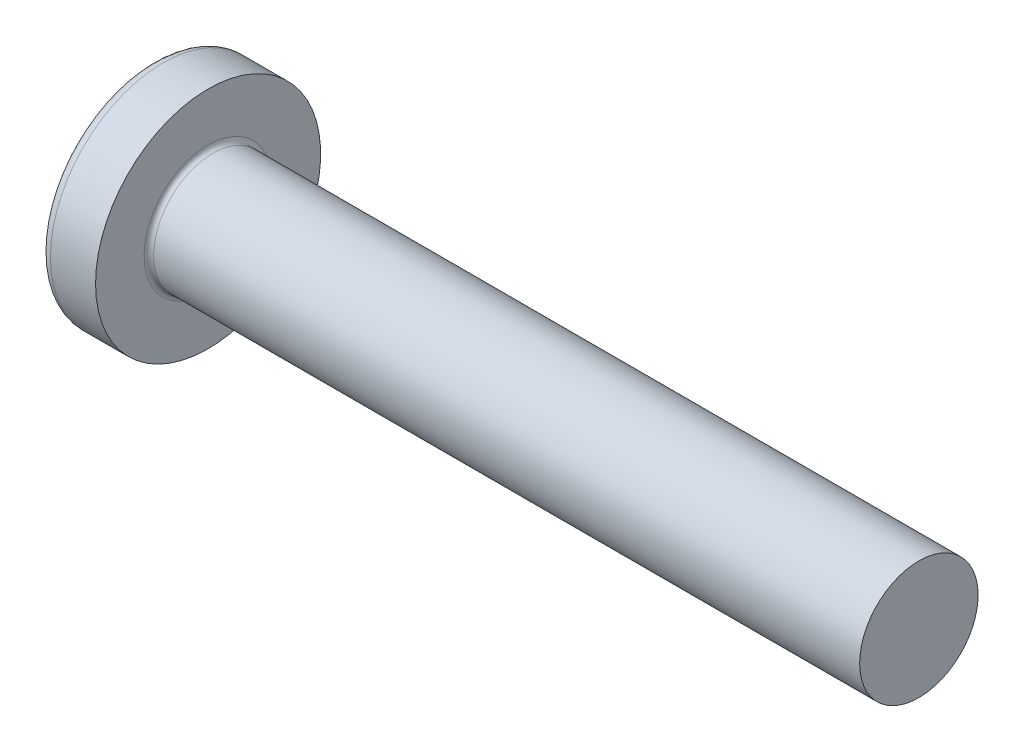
ISO-10303-21;
HEADER;
FILE_DESCRIPTION(('STEP AP214'),'2;1');
FILE_NAME('part.step','',(''),(''),'','','');
FILE_SCHEMA(('AUTOMOTIVE_DESIGN { 1 0 10303 214 1 1 1 1 }'));
ENDSEC;
DATA;
#1=APPLICATION_CONTEXT('core data for automotive mechanical design processes');
#2=APPLICATION_PROTOCOL_DEFINITION('international standard','automotive_design',2000,#1);
#3=PRODUCT_CONTEXT('',#1,'mechanical');
#4=PRODUCT('Part','Part','',(#3));
#5=PRODUCT_RELATED_PRODUCT_CATEGORY('part','',(#4));
#6=PRODUCT_DEFINITION_FORMATION('','',#4);
#7=PRODUCT_DEFINITION_CONTEXT('part definition',#1,'design');
#8=PRODUCT_DEFINITION('design','',#6,#7);
#9=PRODUCT_DEFINITION_SHAPE('','',#8);
#10=(LENGTH_UNIT() NAMED_UNIT(*) SI_UNIT(.MILLI.,.METRE.));
#11=(NAMED_UNIT(*) PLANE_ANGLE_UNIT() SI_UNIT($,.RADIAN.));
#12=(NAMED_UNIT(*) SI_UNIT($,.STERADIAN.) SOLID_ANGLE_UNIT());
#13=UNCERTAINTY_MEASURE_WITH_UNIT(LENGTH_MEASURE(1.E-05),#10,'distance_accuracy_value','');
#14=(GEOMETRIC_REPRESENTATION_CONTEXT(3) GLOBAL_UNCERTAINTY_ASSIGNED_CONTEXT((#13)) GLOBAL_UNIT_ASSIGNED_CONTEXT((#10,
#11,#12)) REPRESENTATION_CONTEXT('',''));
#15=CARTESIAN_POINT('',(0.,0.,0.));
#16=DIRECTION('',(0.,0.,1.));
#17=DIRECTION('',(1.,0.,0.));
#18=AXIS2_PLACEMENT_3D('',#15,#16,#17);
#19=CARTESIAN_POINT('',(8.,0.,0.));
#20=DIRECTION('',(-1.,0.,0.));
#21=DIRECTION('',(0.,1.,0.));
#22=AXIS2_PLACEMENT_3D('',#19,#20,#21);
#23=SPHERICAL_SURFACE('',#22,8.);
#24=CARTESIAN_POINT('',(1.42427123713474,0.,0.));
#25=DIRECTION('',(-1.,0.,0.));
#26=DIRECTION('',(0.,0.,1.));
#27=AXIS2_PLACEMENT_3D('',#24,#25,#26);
#28=CIRCLE('',#27,4.55629139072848);
#29=CARTESIAN_POINT('',(1.42427123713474,0.,4.55629139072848));
#30=VERTEX_POINT('',#29);
#31=EDGE_CURVE('E212',#30,#30,#28,.T.);
#32=ORIENTED_EDGE('',*,*,#31,.T.);
#33=EDGE_LOOP('',(#32));
#34=FACE_BOUND('',#33,.T.);
#35=CARTESIAN_POINT('',(0.0676093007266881,0.,0.));
#36=DIRECTION('',(1.,0.,0.));
#37=DIRECTION('',(0.,0.,-1.));
#38=AXIS2_PLACEMENT_3D('',#35,#36,#37);
#39=CIRCLE('',#38,1.03787176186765);
#40=CARTESIAN_POINT('',(0.0676093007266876,-0.514999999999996,-0.901084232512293));
#41=VERTEX_POINT('',#40);
#42=CARTESIAN_POINT('',(0.0676093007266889,-0.90108423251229,-0.515));
#43=VERTEX_POINT('',#42);
#44=EDGE_CURVE('E338',#41,#43,#39,.F.);
#45=ORIENTED_EDGE('',*,*,#44,.F.);
#46=CARTESIAN_POINT('',(8.,-0.515,0.));
#47=DIRECTION('',(0.,1.,0.));
#48=DIRECTION('',(0.,0.,1.));
#49=AXIS2_PLACEMENT_3D('',#46,#47,#48);
#50=CIRCLE('',#49,7.98340622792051);
#51=CARTESIAN_POINT('',(0.322606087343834,-0.514999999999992,-2.18915456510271));
#52=VERTEX_POINT('',#51);
#53=EDGE_CURVE('E272',#52,#41,#50,.T.);
#54=ORIENTED_EDGE('',*,*,#53,.F.);
#55=CARTESIAN_POINT('',(7.34565714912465,0.,1.31240894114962));
#56=DIRECTION('',(0.446197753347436,0.,-0.894934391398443));
#57=DIRECTION('',(-0.894934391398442,0.,-0.446197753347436));
#58=AXIS2_PLACEMENT_3D('',#55,#56,#57);
#59=CIRCLE('',#58,7.86444010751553);
#60=CARTESIAN_POINT('',(0.322606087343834,0.515000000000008,-2.18915456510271));
#61=VERTEX_POINT('',#60);
#62=EDGE_CURVE('E246',#52,#61,#59,.T.);
#63=ORIENTED_EDGE('',*,*,#62,.T.);
#64=CARTESIAN_POINT('',(8.,0.515,0.));
#65=DIRECTION('',(0.,-1.,0.));
#66=DIRECTION('',(0.,0.,-1.));
#67=AXIS2_PLACEMENT_3D('',#64,#65,#66);
#68=CIRCLE('',#67,7.98340622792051);
#69=CARTESIAN_POINT('',(0.0676093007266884,0.515000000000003,-0.901084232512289));
#70=VERTEX_POINT('',#69);
#71=EDGE_CURVE('E300',#70,#61,#68,.T.);
#72=ORIENTED_EDGE('',*,*,#71,.F.);
#73=CARTESIAN_POINT('',(0.0676093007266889,0.901084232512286,-0.515));
#74=VERTEX_POINT('',#73);
#75=EDGE_CURVE('E353',#74,#70,#39,.F.);
#76=ORIENTED_EDGE('',*,*,#75,.F.);
#77=CARTESIAN_POINT('',(8.,0.,-0.515));
#78=DIRECTION('',(0.,0.,1.));
#79=DIRECTION('',(1.,0.,0.));
#80=AXIS2_PLACEMENT_3D('',#77,#78,#79);
#81=CIRCLE('',#80,7.98340622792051);
#82=CARTESIAN_POINT('',(0.322606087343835,2.18915456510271,-0.515));
#83=VERTEX_POINT('',#82);
#84=EDGE_CURVE('E240',#83,#74,#81,.T.);
#85=ORIENTED_EDGE('',*,*,#84,.F.);
#86=CARTESIAN_POINT('',(7.34565714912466,-1.31240894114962,0.));
#87=DIRECTION('',(0.446197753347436,0.894934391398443,0.));
#88=DIRECTION('',(-0.894934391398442,0.446197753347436,0.));
#89=AXIS2_PLACEMENT_3D('',#86,#87,#88);
#90=CIRCLE('',#89,7.86444010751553);
#91=CARTESIAN_POINT('',(0.322606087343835,2.18915456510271,0.515));
#92=VERTEX_POINT('',#91);
#93=EDGE_CURVE('E243',#83,#92,#90,.T.);
#94=ORIENTED_EDGE('',*,*,#93,.T.);
#95=CARTESIAN_POINT('',(8.,0.,0.515));
#96=DIRECTION('',(0.,0.,-1.));
#97=DIRECTION('',(0.,1.,0.));
#98=AXIS2_PLACEMENT_3D('',#95,#96,#97);
#99=CIRCLE('',#98,7.98340622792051);
#100=CARTESIAN_POINT('',(0.0676093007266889,0.901084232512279,0.514999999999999));
#101=VERTEX_POINT('',#100);
#102=EDGE_CURVE('E236',#101,#92,#99,.T.);
#103=ORIENTED_EDGE('',*,*,#102,.F.);
#104=CARTESIAN_POINT('',(0.067609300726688,0.514999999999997,0.901084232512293));
#105=VERTEX_POINT('',#104);
#106=EDGE_CURVE('E352',#105,#101,#39,.F.);
#107=ORIENTED_EDGE('',*,*,#106,.F.);
#108=CARTESIAN_POINT('',(0.322606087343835,0.514999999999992,2.18915456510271));
#109=VERTEX_POINT('',#108);
#110=EDGE_CURVE('E256',#109,#105,#68,.T.);
#111=ORIENTED_EDGE('',*,*,#110,.F.);
#112=CARTESIAN_POINT('',(7.34565714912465,0.,-1.31240894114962));
#113=DIRECTION('',(0.446197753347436,0.,0.894934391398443));
#114=DIRECTION('',(0.894934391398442,0.,-0.446197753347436));
#115=AXIS2_PLACEMENT_3D('',#112,#113,#114);
#116=CIRCLE('',#115,7.86444010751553);
#117=CARTESIAN_POINT('',(0.322606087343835,-0.515000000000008,2.18915456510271));
#118=VERTEX_POINT('',#117);
#119=EDGE_CURVE('E47',#109,#118,#116,.T.);
#120=ORIENTED_EDGE('',*,*,#119,.T.);
#121=CARTESIAN_POINT('',(0.0676093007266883,-0.515000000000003,0.901084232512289));
#122=VERTEX_POINT('',#121);
#123=EDGE_CURVE('E253',#122,#118,#50,.T.);
#124=ORIENTED_EDGE('',*,*,#123,.F.);
#125=CARTESIAN_POINT('',(0.0676093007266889,-0.901084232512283,0.514999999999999));
#126=VERTEX_POINT('',#125);
#127=EDGE_CURVE('E384',#126,#122,#39,.F.);
#128=ORIENTED_EDGE('',*,*,#127,.F.);
#129=CARTESIAN_POINT('',(0.322606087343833,-2.18915456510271,0.514999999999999));
#130=VERTEX_POINT('',#129);
#131=EDGE_CURVE('E237',#130,#126,#99,.T.);
#132=ORIENTED_EDGE('',*,*,#131,.F.);
#133=CARTESIAN_POINT('',(7.34565714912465,1.31240894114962,0.));
#134=DIRECTION('',(0.446197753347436,-0.894934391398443,0.));
#135=DIRECTION('',(0.894934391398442,0.446197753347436,0.));
#136=AXIS2_PLACEMENT_3D('',#133,#134,#135);
#137=CIRCLE('',#136,7.86444010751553);
#138=CARTESIAN_POINT('',(0.322606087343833,-2.18915456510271,-0.515));
#139=VERTEX_POINT('',#138);
#140=EDGE_CURVE('E233',#130,#139,#137,.T.);
#141=ORIENTED_EDGE('',*,*,#140,.T.);
#142=EDGE_CURVE('E62',#43,#139,#81,.T.);
#143=ORIENTED_EDGE('',*,*,#142,.F.);
#144=EDGE_LOOP('',(#45,#54,#63,#72,#76,#85,#94,#103,#107,#111,#120,#124,#128,#132,#141,#143));
#145=FACE_BOUND('',#144,.T.);
#146=ADVANCED_FACE('F34',(#34,#145),#23,.T.);
#147=CARTESIAN_POINT('',(2.74,0.983886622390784,-0.515));
#148=DIRECTION('',(0.,0.,1.));
#149=DIRECTION('',(1.,0.,0.));
#150=AXIS2_PLACEMENT_3D('',#147,#148,#149);
#151=PLANE('',#150);
#152=ORIENTED_EDGE('',*,*,#84,.T.);
#153=CARTESIAN_POINT('',(-1.51390485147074,1.02651837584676,-0.515));
#154=CARTESIAN_POINT('',(-1.19828075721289,1.00181934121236,-0.515));
#155=CARTESIAN_POINT('',(-0.882669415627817,0.976954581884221,-0.515));
#156=CARTESIAN_POINT('',(-0.251463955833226,0.926774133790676,-0.515));
#157=CARTESIAN_POINT('',(0.0641301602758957,0.901458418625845,-0.515));
#158=CARTESIAN_POINT('',(0.537487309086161,0.863059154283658,-0.515));
#159=CARTESIAN_POINT('',(0.695267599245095,0.85018843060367,-0.515));
#160=CARTESIAN_POINT('',(1.01081295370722,0.824283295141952,-0.515));
#161=CARTESIAN_POINT('',(1.16857801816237,0.811248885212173,-0.515));
#162=CARTESIAN_POINT('',(1.48408237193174,0.784992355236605,-0.515));
#163=CARTESIAN_POINT('',(1.64182166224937,0.77177024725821,-0.515));
#164=CARTESIAN_POINT('',(1.95728793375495,0.745105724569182,-0.515));
#165=CARTESIAN_POINT('',(2.11501491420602,0.731663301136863,-0.515));
#166=CARTESIAN_POINT('',(2.48551875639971,0.699781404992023,-0.515));
#167=CARTESIAN_POINT('',(2.6982865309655,0.681236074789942,-0.515));
#168=CARTESIAN_POINT('',(3.12376344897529,0.643549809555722,-0.515));
#169=CARTESIAN_POINT('',(3.33647259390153,0.624408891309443,-0.515));
#170=CARTESIAN_POINT('',(3.76177021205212,0.585350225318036,-0.515));
#171=CARTESIAN_POINT('',(3.97435870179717,0.5654326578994,-0.515));
#172=CARTESIAN_POINT('',(4.39945864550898,0.524537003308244,-0.515));
#173=CARTESIAN_POINT('',(4.61197008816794,0.503558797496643,-0.515));
#174=CARTESIAN_POINT('',(4.9307163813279,0.470931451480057,-0.515));
#175=CARTESIAN_POINT('',(5.03701000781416,0.459857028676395,-0.515));
#176=CARTESIAN_POINT('',(5.24954252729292,0.437229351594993,-0.515));
#177=CARTESIAN_POINT('',(5.35578142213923,0.425676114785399,-0.515));
#178=CARTESIAN_POINT('',(5.56815317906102,0.401967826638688,-0.515));
#179=CARTESIAN_POINT('',(5.67428606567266,0.389812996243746,-0.515));
#180=CARTESIAN_POINT('',(5.88647145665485,0.36470528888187,-0.515));
#181=CARTESIAN_POINT('',(5.99252394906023,0.351752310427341,-0.515));
#182=CARTESIAN_POINT('',(6.20462993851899,0.324739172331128,-0.515));
#183=CARTESIAN_POINT('',(6.31068325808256,0.31067759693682,-0.515));
#184=CARTESIAN_POINT('',(6.46957142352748,0.288366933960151,-0.515));
#185=CARTESIAN_POINT('',(6.52249184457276,0.280728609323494,-0.515));
#186=CARTESIAN_POINT('',(6.62826070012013,0.26493035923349,-0.515));
#187=CARTESIAN_POINT('',(6.68110912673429,0.256770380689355,-0.515000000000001));
#188=CARTESIAN_POINT('',(6.7867775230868,0.239755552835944,-0.515000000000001));
#189=CARTESIAN_POINT('',(6.83959732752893,0.230899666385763,-0.515000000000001));
#190=CARTESIAN_POINT('',(6.94505554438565,0.212240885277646,-0.515000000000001));
#191=CARTESIAN_POINT('',(6.99769400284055,0.202438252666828,-0.515000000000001));
#192=CARTESIAN_POINT('',(7.10276751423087,0.181407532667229,-0.515000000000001));
#193=CARTESIAN_POINT('',(7.15520220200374,0.170177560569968,-0.515000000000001));
#194=CARTESIAN_POINT('',(7.23345080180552,0.151498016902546,-0.515000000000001));
#195=CARTESIAN_POINT('',(7.25947836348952,0.144962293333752,-0.515000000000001));
#196=CARTESIAN_POINT('',(7.31128722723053,0.130937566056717,-0.515000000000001));
#197=CARTESIAN_POINT('',(7.33706839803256,0.123448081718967,-0.515000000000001));
#198=CARTESIAN_POINT('',(7.36266137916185,0.115313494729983,-0.515000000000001));
#199=B_SPLINE_CURVE_WITH_KNOTS('',3,(#153,#154,#155,#156,#157,#158,#159,#160,#161,#162,#163,
#164,#165,#166,#167,#168,#169,#170,#171,#172,#173,#174,#175,#176,#177,#178,#179,#180,#181,#182,
#183,#184,#185,#186,#187,#188,#189,#190,#191,#192,#193,#194,#195,#196,#197,#198),.UNSPECIFIED.,
.F.,.F.,(4,2,2,2,2,2,2,2,2,2,2,2,2,2,2,2,2,2,2,2,2,2,4),(0.,0.949767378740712,1.89959054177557,
2.37450359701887,2.8494112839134,3.32428857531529,3.79918471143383,4.43990748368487,
5.08061221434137,5.7211690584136,6.36179771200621,6.68240381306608,7.00299822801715,
7.32347576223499,7.6439941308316,7.96492866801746,8.12533320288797,8.28575408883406,
8.44641876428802,8.6070390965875,8.76787376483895,8.84836552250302,8.92889800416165),.UNSPECIFIED.);
#200=CARTESIAN_POINT('',(2.74,0.677477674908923,-0.515));
#201=VERTEX_POINT('',#200);
#202=EDGE_CURVE('E373',#74,#201,#199,.T.);
#203=ORIENTED_EDGE('',*,*,#202,.T.);
#204=DIRECTION('',(0.,1.,0.));
#205=VECTOR('',#204,1.);
#206=CARTESIAN_POINT('',(2.74,-0.983886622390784,-0.515));
#207=LINE('',#206,#205);
#208=CARTESIAN_POINT('',(2.74,0.983886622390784,-0.515));
#209=VERTEX_POINT('',#208);
#210=EDGE_CURVE('E321',#201,#209,#207,.T.);
#211=ORIENTED_EDGE('',*,*,#210,.T.);
#212=DIRECTION('',(0.894934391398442,-0.446197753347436,0.));
#213=VECTOR('',#212,1.);
#214=CARTESIAN_POINT('',(0.,2.35,-0.515));
#215=LINE('',#214,#213);
#216=EDGE_CURVE('E213',#83,#209,#215,.T.);
#217=ORIENTED_EDGE('',*,*,#216,.F.);
#218=EDGE_LOOP('',(#152,#203,#211,#217));
#219=FACE_BOUND('',#218,.T.);
#220=ADVANCED_FACE('F168',(#219),#151,.T.);
#221=CARTESIAN_POINT('',(2.74,-0.983886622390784,-0.515));
#222=VERTEX_POINT('',#221);
#223=CARTESIAN_POINT('',(2.74,-0.677477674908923,-0.515));
#224=VERTEX_POINT('',#223);
#225=EDGE_CURVE('E221',#222,#224,#207,.T.);
#226=ORIENTED_EDGE('',*,*,#225,.T.);
#227=CARTESIAN_POINT('',(-1.51390485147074,-1.02651837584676,-0.515));
#228=CARTESIAN_POINT('',(-1.19828075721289,-1.00181934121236,-0.515));
#229=CARTESIAN_POINT('',(-0.882669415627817,-0.976954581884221,-0.515));
#230=CARTESIAN_POINT('',(-0.251463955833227,-0.926774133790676,-0.515));
#231=CARTESIAN_POINT('',(0.0641301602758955,-0.901458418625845,-0.515));
#232=CARTESIAN_POINT('',(0.537487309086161,-0.863059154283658,-0.515));
#233=CARTESIAN_POINT('',(0.695267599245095,-0.85018843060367,-0.515));
#234=CARTESIAN_POINT('',(1.01081295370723,-0.824283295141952,-0.515));
#235=CARTESIAN_POINT('',(1.16857801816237,-0.811248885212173,-0.515));
#236=CARTESIAN_POINT('',(1.48408237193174,-0.784992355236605,-0.515));
#237=CARTESIAN_POINT('',(1.64182166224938,-0.77177024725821,-0.515));
#238=CARTESIAN_POINT('',(1.95728793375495,-0.745105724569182,-0.515));
#239=CARTESIAN_POINT('',(2.11501491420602,-0.731663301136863,-0.515));
#240=CARTESIAN_POINT('',(2.48551875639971,-0.699781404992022,-0.515));
#241=CARTESIAN_POINT('',(2.6982865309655,-0.681236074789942,-0.515));
#242=CARTESIAN_POINT('',(3.12376344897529,-0.643549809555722,-0.515));
#243=CARTESIAN_POINT('',(3.33647259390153,-0.624408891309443,-0.515));
#244=CARTESIAN_POINT('',(3.76177021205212,-0.585350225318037,-0.515));
#245=CARTESIAN_POINT('',(3.97435870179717,-0.5654326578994,-0.515));
#246=CARTESIAN_POINT('',(4.39945864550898,-0.524537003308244,-0.515));
#247=CARTESIAN_POINT('',(4.61197008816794,-0.503558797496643,-0.515));
#248=CARTESIAN_POINT('',(4.9307163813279,-0.470931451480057,-0.515));
#249=CARTESIAN_POINT('',(5.03701000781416,-0.459857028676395,-0.515));
#250=CARTESIAN_POINT('',(5.24954252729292,-0.437229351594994,-0.515));
#251=CARTESIAN_POINT('',(5.35578142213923,-0.4256761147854,-0.515));
#252=CARTESIAN_POINT('',(5.56815317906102,-0.401967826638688,-0.515));
#253=CARTESIAN_POINT('',(5.67428606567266,-0.389812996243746,-0.515));
#254=CARTESIAN_POINT('',(5.88647145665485,-0.36470528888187,-0.515));
#255=CARTESIAN_POINT('',(5.99252394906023,-0.351752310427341,-0.515));
#256=CARTESIAN_POINT('',(6.204629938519,-0.324739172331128,-0.515));
#257=CARTESIAN_POINT('',(6.31068325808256,-0.31067759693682,-0.515));
#258=CARTESIAN_POINT('',(6.46957142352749,-0.288366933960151,-0.515));
#259=CARTESIAN_POINT('',(6.52249184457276,-0.280728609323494,-0.515));
#260=CARTESIAN_POINT('',(6.62826070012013,-0.26493035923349,-0.515));
#261=CARTESIAN_POINT('',(6.68110912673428,-0.256770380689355,-0.515));
#262=CARTESIAN_POINT('',(6.7867775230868,-0.239755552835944,-0.515));
#263=CARTESIAN_POINT('',(6.83959732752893,-0.230899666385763,-0.515));
#264=CARTESIAN_POINT('',(6.94505554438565,-0.212240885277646,-0.515));
#265=CARTESIAN_POINT('',(6.99769400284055,-0.202438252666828,-0.515000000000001));
#266=CARTESIAN_POINT('',(7.10276751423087,-0.181407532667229,-0.515000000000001));
#267=CARTESIAN_POINT('',(7.15520220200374,-0.170177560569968,-0.515000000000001));
#268=CARTESIAN_POINT('',(7.23345080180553,-0.151498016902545,-0.515000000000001));
#269=CARTESIAN_POINT('',(7.25947836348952,-0.144962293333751,-0.515000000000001));
#270=CARTESIAN_POINT('',(7.31128722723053,-0.130937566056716,-0.515000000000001));
#271=CARTESIAN_POINT('',(7.33706839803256,-0.123448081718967,-0.515000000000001));
#272=CARTESIAN_POINT('',(7.36266137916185,-0.115313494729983,-0.515000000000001));
#273=B_SPLINE_CURVE_WITH_KNOTS('',3,(#227,#228,#229,#230,#231,#232,#233,#234,#235,#236,#237,
#238,#239,#240,#241,#242,#243,#244,#245,#246,#247,#248,#249,#250,#251,#252,#253,#254,#255,#256,
#257,#258,#259,#260,#261,#262,#263,#264,#265,#266,#267,#268,#269,#270,#271,#272),.UNSPECIFIED.,
.F.,.F.,(4,2,2,2,2,2,2,2,2,2,2,2,2,2,2,2,2,2,2,2,2,2,4),(0.,0.949767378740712,1.89959054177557,
2.37450359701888,2.8494112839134,3.32428857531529,3.79918471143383,4.43990748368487,
5.08061221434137,5.7211690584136,6.36179771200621,6.68240381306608,7.00299822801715,
7.32347576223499,7.6439941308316,7.96492866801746,8.12533320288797,8.28575408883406,
8.44641876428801,8.6070390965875,8.76787376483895,8.84836552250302,8.92889800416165),.UNSPECIFIED.);
#274=EDGE_CURVE('E351',#224,#43,#273,.F.);
#275=ORIENTED_EDGE('',*,*,#274,.T.);
#276=ORIENTED_EDGE('',*,*,#142,.T.);
#277=DIRECTION('',(0.894934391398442,0.446197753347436,0.));
#278=VECTOR('',#277,1.);
#279=CARTESIAN_POINT('',(0.,-2.35,-0.515));
#280=LINE('',#279,#278);
#281=EDGE_CURVE('E303',#139,#222,#280,.T.);
#282=ORIENTED_EDGE('',*,*,#281,.T.);
#283=EDGE_LOOP('',(#226,#275,#276,#282));
#284=FACE_BOUND('',#283,.T.);
#285=ADVANCED_FACE('F174',(#284),#151,.T.);
#286=CARTESIAN_POINT('',(2.74,-0.983886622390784,0.515));
#287=DIRECTION('',(0.,0.,-1.));
#288=DIRECTION('',(0.,1.,0.));
#289=AXIS2_PLACEMENT_3D('',#286,#287,#288);
#290=PLANE('',#289);
#291=DIRECTION('',(0.,-1.,0.));
#292=VECTOR('',#291,1.);
#293=CARTESIAN_POINT('',(2.74,0.983886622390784,0.515));
#294=LINE('',#293,#292);
#295=CARTESIAN_POINT('',(2.74,0.983886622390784,0.515));
#296=VERTEX_POINT('',#295);
#297=CARTESIAN_POINT('',(2.74,0.677477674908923,0.515));
#298=VERTEX_POINT('',#297);
#299=EDGE_CURVE('E311',#296,#298,#294,.T.);
#300=ORIENTED_EDGE('',*,*,#299,.T.);
#301=CARTESIAN_POINT('',(-1.51390485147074,1.02651837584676,0.515));
#302=CARTESIAN_POINT('',(-1.19828075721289,1.00181934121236,0.515));
#303=CARTESIAN_POINT('',(-0.882669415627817,0.976954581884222,0.515));
#304=CARTESIAN_POINT('',(-0.251463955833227,0.926774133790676,0.515));
#305=CARTESIAN_POINT('',(0.0641301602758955,0.901458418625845,0.515));
#306=CARTESIAN_POINT('',(0.537487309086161,0.863059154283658,0.515));
#307=CARTESIAN_POINT('',(0.695267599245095,0.85018843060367,0.515));
#308=CARTESIAN_POINT('',(1.01081295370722,0.824283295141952,0.515));
#309=CARTESIAN_POINT('',(1.16857801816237,0.811248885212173,0.515));
#310=CARTESIAN_POINT('',(1.48408237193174,0.784992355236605,0.515));
#311=CARTESIAN_POINT('',(1.64182166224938,0.77177024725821,0.515));
#312=CARTESIAN_POINT('',(1.95728793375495,0.745105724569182,0.515));
#313=CARTESIAN_POINT('',(2.11501491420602,0.731663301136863,0.515));
#314=CARTESIAN_POINT('',(2.48551875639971,0.699781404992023,0.515));
#315=CARTESIAN_POINT('',(2.6982865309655,0.681236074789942,0.515));
#316=CARTESIAN_POINT('',(3.12376344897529,0.643549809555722,0.515));
#317=CARTESIAN_POINT('',(3.33647259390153,0.624408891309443,0.515));
#318=CARTESIAN_POINT('',(3.76177021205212,0.585350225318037,0.515));
#319=CARTESIAN_POINT('',(3.97435870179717,0.5654326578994,0.515));
#320=CARTESIAN_POINT('',(4.39945864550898,0.524537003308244,0.515));
#321=CARTESIAN_POINT('',(4.61197008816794,0.503558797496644,0.515));
#322=CARTESIAN_POINT('',(4.9307163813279,0.470931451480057,0.515));
#323=CARTESIAN_POINT('',(5.03701000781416,0.459857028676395,0.515));
#324=CARTESIAN_POINT('',(5.24954252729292,0.437229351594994,0.515));
#325=CARTESIAN_POINT('',(5.35578142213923,0.4256761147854,0.515));
#326=CARTESIAN_POINT('',(5.56815317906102,0.401967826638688,0.515));
#327=CARTESIAN_POINT('',(5.67428606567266,0.389812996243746,0.515));
#328=CARTESIAN_POINT('',(5.88647145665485,0.36470528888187,0.515));
#329=CARTESIAN_POINT('',(5.99252394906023,0.351752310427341,0.515));
#330=CARTESIAN_POINT('',(6.204629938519,0.324739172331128,0.515));
#331=CARTESIAN_POINT('',(6.31068325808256,0.31067759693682,0.515));
#332=CARTESIAN_POINT('',(6.46957142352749,0.288366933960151,0.515));
#333=CARTESIAN_POINT('',(6.52249184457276,0.280728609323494,0.515));
#334=CARTESIAN_POINT('',(6.62826070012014,0.26493035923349,0.515));
#335=CARTESIAN_POINT('',(6.68110912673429,0.256770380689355,0.515));
#336=CARTESIAN_POINT('',(6.7867775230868,0.239755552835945,0.515));
#337=CARTESIAN_POINT('',(6.83959732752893,0.230899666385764,0.515));
#338=CARTESIAN_POINT('',(6.94505554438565,0.212240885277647,0.515));
#339=CARTESIAN_POINT('',(6.99769400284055,0.202438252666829,0.515));
#340=CARTESIAN_POINT('',(7.10276751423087,0.181407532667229,0.515));
#341=CARTESIAN_POINT('',(7.15520220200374,0.170177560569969,0.515));
#342=CARTESIAN_POINT('',(7.23345080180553,0.151498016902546,0.515));
#343=CARTESIAN_POINT('',(7.25947836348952,0.144962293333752,0.515));
#344=CARTESIAN_POINT('',(7.31128722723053,0.130937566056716,0.515));
#345=CARTESIAN_POINT('',(7.33706839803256,0.123448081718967,0.515));
#346=CARTESIAN_POINT('',(7.36266137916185,0.115313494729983,0.515));
#347=B_SPLINE_CURVE_WITH_KNOTS('',3,(#301,#302,#303,#304,#305,#306,#307,#308,#309,#310,#311,
#312,#313,#314,#315,#316,#317,#318,#319,#320,#321,#322,#323,#324,#325,#326,#327,#328,#329,#330,
#331,#332,#333,#334,#335,#336,#337,#338,#339,#340,#341,#342,#343,#344,#345,#346),.UNSPECIFIED.,
.F.,.F.,(4,2,2,2,2,2,2,2,2,2,2,2,2,2,2,2,2,2,2,2,2,2,4),(0.,0.949767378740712,1.89959054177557,
2.37450359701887,2.8494112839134,3.32428857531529,3.79918471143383,4.43990748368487,
5.08061221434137,5.7211690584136,6.36179771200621,6.68240381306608,7.00299822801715,
7.32347576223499,7.6439941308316,7.96492866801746,8.12533320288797,8.28575408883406,
8.44641876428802,8.6070390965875,8.76787376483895,8.84836552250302,8.92889800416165),.UNSPECIFIED.);
#348=EDGE_CURVE('E277',#298,#101,#347,.F.);
#349=ORIENTED_EDGE('',*,*,#348,.T.);
#350=ORIENTED_EDGE('',*,*,#102,.T.);
#351=DIRECTION('',(0.894934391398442,-0.446197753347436,0.));
#352=VECTOR('',#351,1.);
#353=CARTESIAN_POINT('',(0.,2.35,0.515));
#354=LINE('',#353,#352);
#355=EDGE_CURVE('E218',#92,#296,#354,.T.);
#356=ORIENTED_EDGE('',*,*,#355,.T.);
#357=EDGE_LOOP('',(#300,#349,#350,#356));
#358=FACE_BOUND('',#357,.T.);
#359=ADVANCED_FACE('F369',(#358),#290,.T.);
#360=ORIENTED_EDGE('',*,*,#131,.T.);
#361=CARTESIAN_POINT('',(-1.51390485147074,-1.02651837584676,0.514999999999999));
#362=CARTESIAN_POINT('',(-1.19828075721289,-1.00181934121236,0.514999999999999));
#363=CARTESIAN_POINT('',(-0.882669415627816,-0.976954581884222,0.514999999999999));
#364=CARTESIAN_POINT('',(-0.251463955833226,-0.926774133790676,0.515));
#365=CARTESIAN_POINT('',(0.064130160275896,-0.901458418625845,0.515));
#366=CARTESIAN_POINT('',(0.537487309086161,-0.863059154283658,0.515));
#367=CARTESIAN_POINT('',(0.695267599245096,-0.85018843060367,0.515));
#368=CARTESIAN_POINT('',(1.01081295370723,-0.824283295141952,0.515));
#369=CARTESIAN_POINT('',(1.16857801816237,-0.811248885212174,0.515));
#370=CARTESIAN_POINT('',(1.48408237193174,-0.784992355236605,0.515));
#371=CARTESIAN_POINT('',(1.64182166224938,-0.771770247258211,0.515));
#372=CARTESIAN_POINT('',(1.95728793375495,-0.745105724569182,0.515));
#373=CARTESIAN_POINT('',(2.11501491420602,-0.731663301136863,0.515));
#374=CARTESIAN_POINT('',(2.48551875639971,-0.699781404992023,0.515));
#375=CARTESIAN_POINT('',(2.6982865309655,-0.681236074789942,0.515));
#376=CARTESIAN_POINT('',(3.12376344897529,-0.643549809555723,0.515));
#377=CARTESIAN_POINT('',(3.33647259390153,-0.624408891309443,0.515));
#378=CARTESIAN_POINT('',(3.76177021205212,-0.585350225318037,0.515));
#379=CARTESIAN_POINT('',(3.97435870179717,-0.5654326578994,0.515));
#380=CARTESIAN_POINT('',(4.39945864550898,-0.524537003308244,0.515));
#381=CARTESIAN_POINT('',(4.61197008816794,-0.503558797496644,0.515));
#382=CARTESIAN_POINT('',(4.9307163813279,-0.470931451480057,0.515));
#383=CARTESIAN_POINT('',(5.03701000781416,-0.459857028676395,0.515));
#384=CARTESIAN_POINT('',(5.24954252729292,-0.437229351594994,0.515));
#385=CARTESIAN_POINT('',(5.35578142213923,-0.4256761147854,0.515));
#386=CARTESIAN_POINT('',(5.56815317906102,-0.401967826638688,0.515));
#387=CARTESIAN_POINT('',(5.67428606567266,-0.389812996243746,0.515));
#388=CARTESIAN_POINT('',(5.88647145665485,-0.364705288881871,0.515));
#389=CARTESIAN_POINT('',(5.99252394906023,-0.351752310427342,0.515));
#390=CARTESIAN_POINT('',(6.20462993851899,-0.324739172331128,0.515));
#391=CARTESIAN_POINT('',(6.31068325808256,-0.31067759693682,0.515));
#392=CARTESIAN_POINT('',(6.46957142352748,-0.288366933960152,0.515));
#393=CARTESIAN_POINT('',(6.52249184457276,-0.280728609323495,0.515));
#394=CARTESIAN_POINT('',(6.62826070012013,-0.26493035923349,0.515));
#395=CARTESIAN_POINT('',(6.68110912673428,-0.256770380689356,0.515));
#396=CARTESIAN_POINT('',(6.7867775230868,-0.239755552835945,0.515));
#397=CARTESIAN_POINT('',(6.83959732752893,-0.230899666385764,0.515));
#398=CARTESIAN_POINT('',(6.94505554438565,-0.212240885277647,0.515));
#399=CARTESIAN_POINT('',(6.99769400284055,-0.202438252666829,0.515));
#400=CARTESIAN_POINT('',(7.10276751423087,-0.18140753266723,0.515));
#401=CARTESIAN_POINT('',(7.15520220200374,-0.170177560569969,0.515));
#402=CARTESIAN_POINT('',(7.23345080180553,-0.151498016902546,0.515));
#403=CARTESIAN_POINT('',(7.25947836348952,-0.144962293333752,0.515));
#404=CARTESIAN_POINT('',(7.31128722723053,-0.130937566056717,0.515));
#405=CARTESIAN_POINT('',(7.33706839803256,-0.123448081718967,0.515));
#406=CARTESIAN_POINT('',(7.36266137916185,-0.115313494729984,0.515));
#407=B_SPLINE_CURVE_WITH_KNOTS('',3,(#361,#362,#363,#364,#365,#366,#367,#368,#369,#370,#371,
#372,#373,#374,#375,#376,#377,#378,#379,#380,#381,#382,#383,#384,#385,#386,#387,#388,#389,#390,
#391,#392,#393,#394,#395,#396,#397,#398,#399,#400,#401,#402,#403,#404,#405,#406),.UNSPECIFIED.,
.F.,.F.,(4,2,2,2,2,2,2,2,2,2,2,2,2,2,2,2,2,2,2,2,2,2,4),(0.,0.949767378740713,1.89959054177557,
2.37450359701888,2.8494112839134,3.32428857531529,3.79918471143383,4.43990748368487,
5.08061221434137,5.7211690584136,6.36179771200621,6.68240381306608,7.00299822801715,
7.32347576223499,7.6439941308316,7.96492866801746,8.12533320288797,8.28575408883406,
8.44641876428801,8.6070390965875,8.76787376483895,8.84836552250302,8.92889800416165),.UNSPECIFIED.);
#408=CARTESIAN_POINT('',(2.74,-0.677477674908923,0.515));
#409=VERTEX_POINT('',#408);
#410=EDGE_CURVE('E385',#126,#409,#407,.T.);
#411=ORIENTED_EDGE('',*,*,#410,.T.);
#412=CARTESIAN_POINT('',(2.74,-0.983886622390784,0.515));
#413=VERTEX_POINT('',#412);
#414=EDGE_CURVE('E313',#409,#413,#294,.T.);
#415=ORIENTED_EDGE('',*,*,#414,.T.);
#416=DIRECTION('',(0.894934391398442,0.446197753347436,0.));
#417=VECTOR('',#416,1.);
#418=CARTESIAN_POINT('',(0.,-2.35,0.514999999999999));
#419=LINE('',#418,#417);
#420=EDGE_CURVE('E305',#130,#413,#419,.T.);
#421=ORIENTED_EDGE('',*,*,#420,.F.);
#422=EDGE_LOOP('',(#360,#411,#415,#421));
#423=FACE_BOUND('',#422,.T.);
#424=ADVANCED_FACE('F414',(#423),#290,.T.);
#425=CARTESIAN_POINT('',(2.74,0.983886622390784,-0.515));
#426=DIRECTION('',(-1.,0.,0.));
#427=DIRECTION('',(0.,0.,1.));
#428=AXIS2_PLACEMENT_3D('',#425,#426,#427);
#429=PLANE('',#428);
#430=ORIENTED_EDGE('',*,*,#414,.F.);
#431=CARTESIAN_POINT('',(2.74,0.,0.));
#432=DIRECTION('',(-1.,0.,0.));
#433=DIRECTION('',(0.,0.,1.));
#434=AXIS2_PLACEMENT_3D('',#431,#432,#433);
#435=CIRCLE('',#434,0.851);
#436=EDGE_CURVE('E346',#224,#409,#435,.T.);
#437=ORIENTED_EDGE('',*,*,#436,.F.);
#438=ORIENTED_EDGE('',*,*,#225,.F.);
#439=DIRECTION('',(0.,0.,1.));
#440=VECTOR('',#439,1.);
#441=CARTESIAN_POINT('',(2.74,-0.983886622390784,-0.515));
#442=LINE('',#441,#440);
#443=EDGE_CURVE('E308',#222,#413,#442,.T.);
#444=ORIENTED_EDGE('',*,*,#443,.T.);
#445=EDGE_LOOP('',(#430,#437,#438,#444));
#446=FACE_BOUND('',#445,.T.);
#447=ADVANCED_FACE('F407',(#446),#429,.T.);
#448=DIRECTION('',(0.,0.,-1.));
#449=VECTOR('',#448,1.);
#450=CARTESIAN_POINT('',(2.74,-0.515000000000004,0.983886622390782));
#451=LINE('',#450,#449);
#452=CARTESIAN_POINT('',(2.74,-0.514999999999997,-0.677477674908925));
#453=VERTEX_POINT('',#452);
#454=CARTESIAN_POINT('',(2.74,-0.514999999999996,-0.983886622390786));
#455=VERTEX_POINT('',#454);
#456=EDGE_CURVE('E294',#453,#455,#451,.T.);
#457=ORIENTED_EDGE('',*,*,#456,.F.);
#458=CARTESIAN_POINT('',(2.74,0.515000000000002,-0.677477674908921));
#459=VERTEX_POINT('',#458);
#460=EDGE_CURVE('E54',#459,#453,#435,.T.);
#461=ORIENTED_EDGE('',*,*,#460,.F.);
#462=DIRECTION('',(0.,0.,1.));
#463=VECTOR('',#462,1.);
#464=CARTESIAN_POINT('',(2.74,0.515000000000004,-0.983886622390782));
#465=LINE('',#464,#463);
#466=CARTESIAN_POINT('',(2.74,0.515000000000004,-0.983886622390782));
#467=VERTEX_POINT('',#466);
#468=EDGE_CURVE('E297',#467,#459,#465,.T.);
#469=ORIENTED_EDGE('',*,*,#468,.F.);
#470=DIRECTION('',(0.,-1.,0.));
#471=VECTOR('',#470,1.);
#472=CARTESIAN_POINT('',(2.74,0.515000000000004,-0.983886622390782));
#473=LINE('',#472,#471);
#474=EDGE_CURVE('E288',#467,#455,#473,.T.);
#475=ORIENTED_EDGE('',*,*,#474,.T.);
#476=EDGE_LOOP('',(#457,#461,#469,#475));
#477=FACE_BOUND('',#476,.T.);
#478=ADVANCED_FACE('F341',(#477),#429,.T.);
#479=ORIENTED_EDGE('',*,*,#210,.F.);
#480=EDGE_CURVE('E345',#298,#201,#435,.T.);
#481=ORIENTED_EDGE('',*,*,#480,.F.);
#482=ORIENTED_EDGE('',*,*,#299,.F.);
#483=DIRECTION('',(0.,0.,-1.));
#484=VECTOR('',#483,1.);
#485=CARTESIAN_POINT('',(2.74,0.983886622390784,0.515));
#486=LINE('',#485,#484);
#487=EDGE_CURVE('E314',#296,#209,#486,.T.);
#488=ORIENTED_EDGE('',*,*,#487,.T.);
#489=EDGE_LOOP('',(#479,#481,#482,#488));
#490=FACE_BOUND('',#489,.T.);
#491=ADVANCED_FACE('F408',(#490),#429,.T.);
#492=CARTESIAN_POINT('',(2.74,0.514999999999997,0.983886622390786));
#493=DIRECTION('',(0.,-1.,0.));
#494=DIRECTION('',(1.,0.,0.));
#495=AXIS2_PLACEMENT_3D('',#492,#493,#494);
#496=PLANE('',#495);
#497=ORIENTED_EDGE('',*,*,#110,.T.);
#498=CARTESIAN_POINT('',(-1.51390484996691,0.514999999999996,1.02651837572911));
#499=CARTESIAN_POINT('',(-1.19828075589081,0.514999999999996,1.00181934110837));
#500=CARTESIAN_POINT('',(-0.882669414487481,0.514999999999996,0.976954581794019));
#501=CARTESIAN_POINT('',(-0.251463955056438,0.514999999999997,0.92677413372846));
#502=CARTESIAN_POINT('',(0.0641301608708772,0.514999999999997,0.901458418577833));
#503=CARTESIAN_POINT('',(0.537487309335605,0.514999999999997,0.8630591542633));
#504=CARTESIAN_POINT('',(0.695267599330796,0.514999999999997,0.850188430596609));
#505=CARTESIAN_POINT('',(1.01081295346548,0.514999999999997,0.824283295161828));
#506=CARTESIAN_POINT('',(1.16857801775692,0.514999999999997,0.811248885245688));
#507=CARTESIAN_POINT('',(1.48408237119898,0.514999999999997,0.784992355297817));
#508=CARTESIAN_POINT('',(1.64182166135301,0.514999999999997,0.77177024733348));
#509=CARTESIAN_POINT('',(1.95728793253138,0.514999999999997,0.745105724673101));
#510=CARTESIAN_POINT('',(2.11501491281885,0.514999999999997,0.731663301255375));
#511=CARTESIAN_POINT('',(2.48551875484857,0.514999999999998,0.699781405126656));
#512=CARTESIAN_POINT('',(2.69828652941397,0.514999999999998,0.681236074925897));
#513=CARTESIAN_POINT('',(3.12376344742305,0.514999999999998,0.643549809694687));
#514=CARTESIAN_POINT('',(3.33647259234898,0.514999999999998,0.624408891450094));
#515=CARTESIAN_POINT('',(3.76177021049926,0.514999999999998,0.585350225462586));
#516=CARTESIAN_POINT('',(3.97435870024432,0.514999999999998,0.56543265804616));
#517=CARTESIAN_POINT('',(4.39945864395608,0.514999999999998,0.524537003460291));
#518=CARTESIAN_POINT('',(4.61197008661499,0.514999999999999,0.503558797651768));
#519=CARTESIAN_POINT('',(4.93071637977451,0.514999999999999,0.47093145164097));
#520=CARTESIAN_POINT('',(5.03701000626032,0.514999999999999,0.459857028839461));
#521=CARTESIAN_POINT('',(5.24954252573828,0.514999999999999,0.43722935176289));
#522=CARTESIAN_POINT('',(5.35578142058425,0.514999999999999,0.425676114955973));
#523=CARTESIAN_POINT('',(5.56815317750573,0.514999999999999,0.40196782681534));
#524=CARTESIAN_POINT('',(5.6742860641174,0.514999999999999,0.389812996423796));
#525=CARTESIAN_POINT('',(5.88647145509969,0.514999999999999,0.364705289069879));
#526=CARTESIAN_POINT('',(5.99252394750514,0.514999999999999,0.351752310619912));
#527=CARTESIAN_POINT('',(6.20462993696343,0.514999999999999,0.32473917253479));
#528=CARTESIAN_POINT('',(6.31068325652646,0.514999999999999,0.310677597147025));
#529=CARTESIAN_POINT('',(6.46957142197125,0.514999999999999,0.288366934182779));
#530=CARTESIAN_POINT('',(6.52249184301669,0.514999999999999,0.28072860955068));
#531=CARTESIAN_POINT('',(6.62826069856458,0.514999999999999,0.264930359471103));
#532=CARTESIAN_POINT('',(6.68110912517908,0.515,0.256770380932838));
#533=CARTESIAN_POINT('',(6.78677752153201,0.515,0.239755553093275));
#534=CARTESIAN_POINT('',(6.83959732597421,0.515,0.230899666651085));
#535=CARTESIAN_POINT('',(6.94505554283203,0.515,0.212240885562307));
#536=CARTESIAN_POINT('',(6.99769400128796,0.515,0.202438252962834));
#537=CARTESIAN_POINT('',(7.10276751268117,0.515,0.181407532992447));
#538=CARTESIAN_POINT('',(7.1552022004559,0.515,0.170177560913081));
#539=CARTESIAN_POINT('',(7.23345080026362,0.515,0.151498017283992));
#540=CARTESIAN_POINT('',(7.25947836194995,0.515,0.144962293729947));
#541=CARTESIAN_POINT('',(7.31128722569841,0.515,0.130937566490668));
#542=CARTESIAN_POINT('',(7.33706839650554,0.515,0.123448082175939));
#543=CARTESIAN_POINT('',(7.36266137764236,0.515,0.115313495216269));
#544=B_SPLINE_CURVE_WITH_KNOTS('',3,(#498,#499,#500,#501,#502,#503,#504,#505,#506,#507,#508,
#509,#510,#511,#512,#513,#514,#515,#516,#517,#518,#519,#520,#521,#522,#523,#524,#525,#526,#527,
#528,#529,#530,#531,#532,#533,#534,#535,#536,#537,#538,#539,#540,#541,#542,#543),.UNSPECIFIED.,
.F.,.F.,(4,2,2,2,2,2,2,2,2,2,2,2,2,2,2,2,2,2,2,2,2,2,4),(0.,0.949767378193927,1.89959054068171,
2.37450359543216,2.84941128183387,3.32428857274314,3.79918470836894,4.43990748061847,
5.08061221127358,5.72116905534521,6.36179770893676,6.68240380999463,7.0029982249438,
7.32347575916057,7.64399412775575,7.96492866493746,8.12533319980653,8.28575408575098,
8.44641876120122,8.60703909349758,8.76787376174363,8.84836551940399,8.92889800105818),.UNSPECIFIED.);
#545=CARTESIAN_POINT('',(2.74,0.514999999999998,0.677477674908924));
#546=VERTEX_POINT('',#545);
#547=EDGE_CURVE('E432',#105,#546,#544,.T.);
#548=ORIENTED_EDGE('',*,*,#547,.T.);
#549=CARTESIAN_POINT('',(2.74,0.514999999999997,0.983886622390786));
#550=VERTEX_POINT('',#549);
#551=EDGE_CURVE('E270',#546,#550,#465,.T.);
#552=ORIENTED_EDGE('',*,*,#551,.T.);
#553=DIRECTION('',(0.894934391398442,0.,-0.446197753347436));
#554=VECTOR('',#553,1.);
#555=CARTESIAN_POINT('',(0.,0.514999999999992,2.35));
#556=LINE('',#555,#554);
#557=EDGE_CURVE('E263',#109,#550,#556,.T.);
#558=ORIENTED_EDGE('',*,*,#557,.F.);
#559=EDGE_LOOP('',(#497,#548,#552,#558));
#560=FACE_BOUND('',#559,.T.);
#561=ADVANCED_FACE('F267',(#560),#496,.T.);
#562=CARTESIAN_POINT('',(2.74,-0.514999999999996,-0.983886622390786));
#563=DIRECTION('',(0.,1.,0.));
#564=DIRECTION('',(0.,0.,1.));
#565=AXIS2_PLACEMENT_3D('',#562,#563,#564);
#566=PLANE('',#565);
#567=CARTESIAN_POINT('',(2.74,-0.515000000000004,0.983886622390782));
#568=VERTEX_POINT('',#567);
#569=CARTESIAN_POINT('',(2.74,-0.515000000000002,0.677477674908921));
#570=VERTEX_POINT('',#569);
#571=EDGE_CURVE('E291',#568,#570,#451,.T.);
#572=ORIENTED_EDGE('',*,*,#571,.T.);
#573=CARTESIAN_POINT('',(-1.51390485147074,-0.515000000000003,1.02651837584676));
#574=CARTESIAN_POINT('',(-1.19828075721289,-0.515000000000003,1.00181934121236));
#575=CARTESIAN_POINT('',(-0.882669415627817,-0.515000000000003,0.97695458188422));
#576=CARTESIAN_POINT('',(-0.251463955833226,-0.515000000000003,0.926774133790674));
#577=CARTESIAN_POINT('',(0.0641301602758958,-0.515000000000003,0.901458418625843));
#578=CARTESIAN_POINT('',(0.537487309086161,-0.515000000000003,0.863059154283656));
#579=CARTESIAN_POINT('',(0.695267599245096,-0.515000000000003,0.850188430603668));
#580=CARTESIAN_POINT('',(1.01081295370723,-0.515000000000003,0.824283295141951));
#581=CARTESIAN_POINT('',(1.16857801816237,-0.515000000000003,0.811248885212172));
#582=CARTESIAN_POINT('',(1.48408237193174,-0.515000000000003,0.784992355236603));
#583=CARTESIAN_POINT('',(1.64182166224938,-0.515000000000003,0.771770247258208));
#584=CARTESIAN_POINT('',(1.95728793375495,-0.515000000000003,0.74510572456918));
#585=CARTESIAN_POINT('',(2.11501491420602,-0.515000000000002,0.731663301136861));
#586=CARTESIAN_POINT('',(2.48551875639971,-0.515000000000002,0.699781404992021));
#587=CARTESIAN_POINT('',(2.6982865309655,-0.515000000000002,0.68123607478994));
#588=CARTESIAN_POINT('',(3.12376344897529,-0.515000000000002,0.643549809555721));
#589=CARTESIAN_POINT('',(3.33647259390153,-0.515000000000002,0.624408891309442));
#590=CARTESIAN_POINT('',(3.76177021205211,-0.515000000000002,0.585350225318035));
#591=CARTESIAN_POINT('',(3.97435870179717,-0.515000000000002,0.565432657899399));
#592=CARTESIAN_POINT('',(4.39945864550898,-0.515000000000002,0.524537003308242));
#593=CARTESIAN_POINT('',(4.61197008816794,-0.515000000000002,0.503558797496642));
#594=CARTESIAN_POINT('',(4.9307163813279,-0.515000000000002,0.470931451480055));
#595=CARTESIAN_POINT('',(5.03701000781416,-0.515000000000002,0.459857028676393));
#596=CARTESIAN_POINT('',(5.24954252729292,-0.515000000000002,0.437229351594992));
#597=CARTESIAN_POINT('',(5.35578142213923,-0.515000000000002,0.425676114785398));
#598=CARTESIAN_POINT('',(5.56815317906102,-0.515000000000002,0.401967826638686));
#599=CARTESIAN_POINT('',(5.67428606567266,-0.515000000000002,0.389812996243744));
#600=CARTESIAN_POINT('',(5.88647145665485,-0.515000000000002,0.364705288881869));
#601=CARTESIAN_POINT('',(5.99252394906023,-0.515000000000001,0.35175231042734));
#602=CARTESIAN_POINT('',(6.20462993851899,-0.515000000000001,0.324739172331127));
#603=CARTESIAN_POINT('',(6.31068325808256,-0.515000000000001,0.310677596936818));
#604=CARTESIAN_POINT('',(6.46957142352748,-0.515000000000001,0.28836693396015));
#605=CARTESIAN_POINT('',(6.52249184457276,-0.515000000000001,0.280728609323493));
#606=CARTESIAN_POINT('',(6.62826070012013,-0.515000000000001,0.264930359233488));
#607=CARTESIAN_POINT('',(6.68110912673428,-0.515000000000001,0.256770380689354));
#608=CARTESIAN_POINT('',(6.7867775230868,-0.515000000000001,0.239755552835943));
#609=CARTESIAN_POINT('',(6.83959732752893,-0.515000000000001,0.230899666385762));
#610=CARTESIAN_POINT('',(6.94505554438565,-0.515000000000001,0.212240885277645));
#611=CARTESIAN_POINT('',(6.99769400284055,-0.515000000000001,0.202438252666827));
#612=CARTESIAN_POINT('',(7.10276751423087,-0.515000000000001,0.181407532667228));
#613=CARTESIAN_POINT('',(7.15520220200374,-0.515000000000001,0.170177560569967));
#614=CARTESIAN_POINT('',(7.23345080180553,-0.515000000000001,0.151498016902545));
#615=CARTESIAN_POINT('',(7.25947836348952,-0.515000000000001,0.144962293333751));
#616=CARTESIAN_POINT('',(7.31128722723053,-0.515000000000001,0.130937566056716));
#617=CARTESIAN_POINT('',(7.33706839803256,-0.515000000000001,0.123448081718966));
#618=CARTESIAN_POINT('',(7.36266137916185,-0.515000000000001,0.115313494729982));
#619=B_SPLINE_CURVE_WITH_KNOTS('',3,(#573,#574,#575,#576,#577,#578,#579,#580,#581,#582,#583,
#584,#585,#586,#587,#588,#589,#590,#591,#592,#593,#594,#595,#596,#597,#598,#599,#600,#601,#602,
#603,#604,#605,#606,#607,#608,#609,#610,#611,#612,#613,#614,#615,#616,#617,#618),.UNSPECIFIED.,
.F.,.F.,(4,2,2,2,2,2,2,2,2,2,2,2,2,2,2,2,2,2,2,2,2,2,4),(0.,0.949767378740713,1.89959054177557,
2.37450359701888,2.8494112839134,3.32428857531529,3.79918471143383,4.43990748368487,
5.08061221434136,5.72116905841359,6.36179771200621,6.68240381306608,7.00299822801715,
7.32347576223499,7.6439941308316,7.96492866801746,8.12533320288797,8.28575408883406,
8.44641876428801,8.6070390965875,8.76787376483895,8.84836552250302,8.92889800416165),.UNSPECIFIED.);
#620=EDGE_CURVE('E378',#570,#122,#619,.F.);
#621=ORIENTED_EDGE('',*,*,#620,.T.);
#622=ORIENTED_EDGE('',*,*,#123,.T.);
#623=DIRECTION('',(0.894934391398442,0.,-0.446197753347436));
#624=VECTOR('',#623,1.);
#625=CARTESIAN_POINT('',(0.,-0.515000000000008,2.35));
#626=LINE('',#625,#624);
#627=EDGE_CURVE('E265',#118,#568,#626,.T.);
#628=ORIENTED_EDGE('',*,*,#627,.T.);
#629=EDGE_LOOP('',(#572,#621,#622,#628));
#630=FACE_BOUND('',#629,.T.);
#631=ADVANCED_FACE('F203',(#630),#566,.T.);
#632=ORIENTED_EDGE('',*,*,#468,.T.);
#633=CARTESIAN_POINT('',(-1.51390485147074,0.515000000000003,-1.02651837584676));
#634=CARTESIAN_POINT('',(-1.19828075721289,0.515000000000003,-1.00181934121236));
#635=CARTESIAN_POINT('',(-0.882669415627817,0.515000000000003,-0.97695458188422));
#636=CARTESIAN_POINT('',(-0.251463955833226,0.515000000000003,-0.926774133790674));
#637=CARTESIAN_POINT('',(0.0641301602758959,0.515000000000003,-0.901458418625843));
#638=CARTESIAN_POINT('',(0.537487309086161,0.515000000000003,-0.863059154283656));
#639=CARTESIAN_POINT('',(0.695267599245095,0.515000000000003,-0.850188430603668));
#640=CARTESIAN_POINT('',(1.01081295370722,0.515000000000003,-0.82428329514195));
#641=CARTESIAN_POINT('',(1.16857801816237,0.515000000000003,-0.811248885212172));
#642=CARTESIAN_POINT('',(1.48408237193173,0.515000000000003,-0.784992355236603));
#643=CARTESIAN_POINT('',(1.64182166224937,0.515000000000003,-0.771770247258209));
#644=CARTESIAN_POINT('',(1.95728793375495,0.515000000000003,-0.74510572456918));
#645=CARTESIAN_POINT('',(2.11501491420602,0.515000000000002,-0.731663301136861));
#646=CARTESIAN_POINT('',(2.48551875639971,0.515000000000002,-0.699781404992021));
#647=CARTESIAN_POINT('',(2.6982865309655,0.515000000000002,-0.68123607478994));
#648=CARTESIAN_POINT('',(3.12376344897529,0.515000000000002,-0.643549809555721));
#649=CARTESIAN_POINT('',(3.33647259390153,0.515000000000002,-0.624408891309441));
#650=CARTESIAN_POINT('',(3.76177021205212,0.515000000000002,-0.585350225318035));
#651=CARTESIAN_POINT('',(3.97435870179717,0.515000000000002,-0.565432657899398));
#652=CARTESIAN_POINT('',(4.39945864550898,0.515000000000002,-0.524537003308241));
#653=CARTESIAN_POINT('',(4.61197008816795,0.515000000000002,-0.503558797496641));
#654=CARTESIAN_POINT('',(4.9307163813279,0.515000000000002,-0.470931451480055));
#655=CARTESIAN_POINT('',(5.03701000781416,0.515000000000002,-0.459857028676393));
#656=CARTESIAN_POINT('',(5.24954252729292,0.515000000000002,-0.437229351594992));
#657=CARTESIAN_POINT('',(5.35578142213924,0.515000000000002,-0.425676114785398));
#658=CARTESIAN_POINT('',(5.56815317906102,0.515000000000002,-0.401967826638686));
#659=CARTESIAN_POINT('',(5.67428606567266,0.515000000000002,-0.389812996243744));
#660=CARTESIAN_POINT('',(5.88647145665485,0.515000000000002,-0.364705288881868));
#661=CARTESIAN_POINT('',(5.99252394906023,0.515000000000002,-0.351752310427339));
#662=CARTESIAN_POINT('',(6.204629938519,0.515000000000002,-0.324739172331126));
#663=CARTESIAN_POINT('',(6.31068325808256,0.515000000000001,-0.310677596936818));
#664=CARTESIAN_POINT('',(6.46957142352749,0.515000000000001,-0.28836693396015));
#665=CARTESIAN_POINT('',(6.52249184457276,0.515000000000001,-0.280728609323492));
#666=CARTESIAN_POINT('',(6.62826070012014,0.515000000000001,-0.264930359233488));
#667=CARTESIAN_POINT('',(6.68110912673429,0.515000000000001,-0.256770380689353));
#668=CARTESIAN_POINT('',(6.7867775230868,0.515000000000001,-0.239755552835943));
#669=CARTESIAN_POINT('',(6.83959732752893,0.515000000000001,-0.230899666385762));
#670=CARTESIAN_POINT('',(6.94505554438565,0.515000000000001,-0.212240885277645));
#671=CARTESIAN_POINT('',(6.99769400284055,0.515000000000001,-0.202438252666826));
#672=CARTESIAN_POINT('',(7.10276751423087,0.515000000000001,-0.181407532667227));
#673=CARTESIAN_POINT('',(7.15520220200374,0.515000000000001,-0.170177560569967));
#674=CARTESIAN_POINT('',(7.23345080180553,0.515000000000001,-0.151498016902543));
#675=CARTESIAN_POINT('',(7.25947836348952,0.515000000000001,-0.14496229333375));
#676=CARTESIAN_POINT('',(7.31128722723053,0.515000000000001,-0.130937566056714));
#677=CARTESIAN_POINT('',(7.33706839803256,0.515000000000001,-0.123448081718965));
#678=CARTESIAN_POINT('',(7.36266137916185,0.515000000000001,-0.115313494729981));
#679=B_SPLINE_CURVE_WITH_KNOTS('',3,(#633,#634,#635,#636,#637,#638,#639,#640,#641,#642,#643,
#644,#645,#646,#647,#648,#649,#650,#651,#652,#653,#654,#655,#656,#657,#658,#659,#660,#661,#662,
#663,#664,#665,#666,#667,#668,#669,#670,#671,#672,#673,#674,#675,#676,#677,#678),.UNSPECIFIED.,
.F.,.F.,(4,2,2,2,2,2,2,2,2,2,2,2,2,2,2,2,2,2,2,2,2,2,4),(0.,0.949767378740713,1.89959054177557,
2.37450359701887,2.8494112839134,3.32428857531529,3.79918471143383,4.43990748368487,
5.08061221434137,5.7211690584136,6.36179771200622,6.68240381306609,7.00299822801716,
7.32347576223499,7.6439941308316,7.96492866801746,8.12533320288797,8.28575408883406,
8.44641876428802,8.6070390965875,8.76787376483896,8.84836552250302,8.92889800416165),.UNSPECIFIED.);
#680=EDGE_CURVE('E330',#459,#70,#679,.F.);
#681=ORIENTED_EDGE('',*,*,#680,.T.);
#682=ORIENTED_EDGE('',*,*,#71,.T.);
#683=DIRECTION('',(0.894934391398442,0.,0.446197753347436));
#684=VECTOR('',#683,1.);
#685=CARTESIAN_POINT('',(0.,0.515000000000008,-2.35));
#686=LINE('',#685,#684);
#687=EDGE_CURVE('E274',#61,#467,#686,.T.);
#688=ORIENTED_EDGE('',*,*,#687,.T.);
#689=EDGE_LOOP('',(#632,#681,#682,#688));
#690=FACE_BOUND('',#689,.T.);
#691=ADVANCED_FACE('F201',(#690),#496,.T.);
#692=ORIENTED_EDGE('',*,*,#53,.T.);
#693=CARTESIAN_POINT('',(-1.51390484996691,-0.514999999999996,-1.02651837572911));
#694=CARTESIAN_POINT('',(-1.19828075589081,-0.514999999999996,-1.00181934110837));
#695=CARTESIAN_POINT('',(-0.882669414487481,-0.514999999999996,-0.976954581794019));
#696=CARTESIAN_POINT('',(-0.251463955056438,-0.514999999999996,-0.92677413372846));
#697=CARTESIAN_POINT('',(0.0641301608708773,-0.514999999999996,-0.901458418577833));
#698=CARTESIAN_POINT('',(0.537487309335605,-0.514999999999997,-0.8630591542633));
#699=CARTESIAN_POINT('',(0.695267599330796,-0.514999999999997,-0.850188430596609));
#700=CARTESIAN_POINT('',(1.01081295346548,-0.514999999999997,-0.824283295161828));
#701=CARTESIAN_POINT('',(1.16857801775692,-0.514999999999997,-0.811248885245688));
#702=CARTESIAN_POINT('',(1.48408237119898,-0.514999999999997,-0.784992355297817));
#703=CARTESIAN_POINT('',(1.64182166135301,-0.514999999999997,-0.77177024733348));
#704=CARTESIAN_POINT('',(1.95728793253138,-0.514999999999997,-0.745105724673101));
#705=CARTESIAN_POINT('',(2.11501491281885,-0.514999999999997,-0.731663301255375));
#706=CARTESIAN_POINT('',(2.48551875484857,-0.514999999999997,-0.699781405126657));
#707=CARTESIAN_POINT('',(2.69828652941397,-0.514999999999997,-0.681236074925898));
#708=CARTESIAN_POINT('',(3.12376344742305,-0.514999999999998,-0.643549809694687));
#709=CARTESIAN_POINT('',(3.33647259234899,-0.514999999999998,-0.624408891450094));
#710=CARTESIAN_POINT('',(3.76177021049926,-0.514999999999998,-0.585350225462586));
#711=CARTESIAN_POINT('',(3.97435870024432,-0.514999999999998,-0.56543265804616));
#712=CARTESIAN_POINT('',(4.39945864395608,-0.514999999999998,-0.524537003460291));
#713=CARTESIAN_POINT('',(4.61197008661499,-0.514999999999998,-0.503558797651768));
#714=CARTESIAN_POINT('',(4.93071637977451,-0.514999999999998,-0.47093145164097));
#715=CARTESIAN_POINT('',(5.03701000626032,-0.514999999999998,-0.459857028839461));
#716=CARTESIAN_POINT('',(5.24954252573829,-0.514999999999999,-0.43722935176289));
#717=CARTESIAN_POINT('',(5.35578142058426,-0.514999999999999,-0.425676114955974));
#718=CARTESIAN_POINT('',(5.56815317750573,-0.514999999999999,-0.40196782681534));
#719=CARTESIAN_POINT('',(5.6742860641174,-0.514999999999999,-0.389812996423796));
#720=CARTESIAN_POINT('',(5.88647145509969,-0.514999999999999,-0.364705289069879));
#721=CARTESIAN_POINT('',(5.99252394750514,-0.514999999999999,-0.351752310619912));
#722=CARTESIAN_POINT('',(6.20462993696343,-0.514999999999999,-0.324739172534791));
#723=CARTESIAN_POINT('',(6.31068325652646,-0.514999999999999,-0.310677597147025));
#724=CARTESIAN_POINT('',(6.46957142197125,-0.514999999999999,-0.288366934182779));
#725=CARTESIAN_POINT('',(6.52249184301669,-0.514999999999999,-0.28072860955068));
#726=CARTESIAN_POINT('',(6.62826069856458,-0.514999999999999,-0.264930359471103));
#727=CARTESIAN_POINT('',(6.68110912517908,-0.514999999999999,-0.256770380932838));
#728=CARTESIAN_POINT('',(6.78677752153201,-0.514999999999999,-0.239755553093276));
#729=CARTESIAN_POINT('',(6.83959732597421,-0.514999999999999,-0.230899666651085));
#730=CARTESIAN_POINT('',(6.94505554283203,-0.514999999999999,-0.212240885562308));
#731=CARTESIAN_POINT('',(6.99769400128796,-0.514999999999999,-0.202438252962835));
#732=CARTESIAN_POINT('',(7.10276751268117,-0.515,-0.181407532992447));
#733=CARTESIAN_POINT('',(7.1552022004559,-0.515,-0.170177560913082));
#734=CARTESIAN_POINT('',(7.23345080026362,-0.515,-0.151498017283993));
#735=CARTESIAN_POINT('',(7.25947836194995,-0.515,-0.144962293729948));
#736=CARTESIAN_POINT('',(7.31128722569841,-0.515,-0.130937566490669));
#737=CARTESIAN_POINT('',(7.33706839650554,-0.515,-0.123448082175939));
#738=CARTESIAN_POINT('',(7.36266137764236,-0.515,-0.11531349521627));
#739=B_SPLINE_CURVE_WITH_KNOTS('',3,(#693,#694,#695,#696,#697,#698,#699,#700,#701,#702,#703,
#704,#705,#706,#707,#708,#709,#710,#711,#712,#713,#714,#715,#716,#717,#718,#719,#720,#721,#722,
#723,#724,#725,#726,#727,#728,#729,#730,#731,#732,#733,#734,#735,#736,#737,#738),.UNSPECIFIED.,
.F.,.F.,(4,2,2,2,2,2,2,2,2,2,2,2,2,2,2,2,2,2,2,2,2,2,4),(0.,0.949767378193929,1.89959054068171,
2.37450359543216,2.84941128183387,3.32428857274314,3.79918470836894,4.43990748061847,
5.08061221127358,5.72116905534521,6.36179770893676,6.68240380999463,7.0029982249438,
7.32347575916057,7.64399412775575,7.96492866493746,8.12533319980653,8.28575408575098,
8.44641876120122,8.60703909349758,8.76787376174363,8.84836551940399,8.92889800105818),.UNSPECIFIED.);
#740=EDGE_CURVE('E11',#41,#453,#739,.T.);
#741=ORIENTED_EDGE('',*,*,#740,.T.);
#742=ORIENTED_EDGE('',*,*,#456,.T.);
#743=DIRECTION('',(0.894934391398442,0.,0.446197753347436));
#744=VECTOR('',#743,1.);
#745=CARTESIAN_POINT('',(0.,-0.514999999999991,-2.35));
#746=LINE('',#745,#744);
#747=EDGE_CURVE('E285',#52,#455,#746,.T.);
#748=ORIENTED_EDGE('',*,*,#747,.F.);
#749=EDGE_LOOP('',(#692,#741,#742,#748));
#750=FACE_BOUND('',#749,.T.);
#751=ADVANCED_FACE('F196',(#750),#566,.T.);
#752=CARTESIAN_POINT('',(-25.4,0.,0.));
#753=DIRECTION('',(-1.,0.,0.));
#754=DIRECTION('',(0.,0.,1.));
#755=AXIS2_PLACEMENT_3D('',#752,#753,#754);
#756=CYLINDRICAL_SURFACE('',#755,2.5);
#757=CARTESIAN_POINT('',(3.9,0.,0.));
#758=DIRECTION('',(-1.,0.,0.));
#759=DIRECTION('',(0.,0.,1.));
#760=AXIS2_PLACEMENT_3D('',#757,#758,#759);
#761=CIRCLE('',#760,2.5);
#762=CARTESIAN_POINT('',(3.9,0.,2.5));
#763=VERTEX_POINT('',#762);
#764=EDGE_CURVE('E207',#763,#763,#761,.F.);
#765=ORIENTED_EDGE('',*,*,#764,.T.);
#766=EDGE_LOOP('',(#765));
#767=FACE_BOUND('',#766,.T.);
#768=CARTESIAN_POINT('',(33.7,0.,0.));
#769=DIRECTION('',(-1.,0.,0.));
#770=DIRECTION('',(0.,0.,1.));
#771=AXIS2_PLACEMENT_3D('',#768,#769,#770);
#772=CIRCLE('',#771,2.5);
#773=CARTESIAN_POINT('',(33.7,0.,2.5));
#774=VERTEX_POINT('',#773);
#775=EDGE_CURVE('E210',#774,#774,#772,.T.);
#776=ORIENTED_EDGE('',*,*,#775,.T.);
#777=EDGE_LOOP('',(#776));
#778=FACE_BOUND('',#777,.T.);
#779=ADVANCED_FACE('F193',(#767,#778),#756,.T.);
#780=CARTESIAN_POINT('',(3.7,2.5,0.));
#781=DIRECTION('',(-1.,0.,0.));
#782=DIRECTION('',(0.,0.,1.));
#783=AXIS2_PLACEMENT_3D('',#780,#781,#782);
#784=PLANE('',#783);
#785=CARTESIAN_POINT('',(3.7,0.,0.));
#786=DIRECTION('',(-1.,0.,0.));
#787=DIRECTION('',(0.,0.,1.));
#788=AXIS2_PLACEMENT_3D('',#785,#786,#787);
#789=CIRCLE('',#788,2.7);
#790=CARTESIAN_POINT('',(3.7,0.,2.7));
#791=VERTEX_POINT('',#790);
#792=EDGE_CURVE('E229',#791,#791,#789,.T.);
#793=ORIENTED_EDGE('',*,*,#792,.T.);
#794=EDGE_LOOP('',(#793));
#795=FACE_BOUND('',#794,.T.);
#796=CARTESIAN_POINT('',(3.7,0.,0.));
#797=DIRECTION('',(-1.,0.,0.));
#798=DIRECTION('',(0.,0.,1.));
#799=AXIS2_PLACEMENT_3D('',#796,#797,#798);
#800=CIRCLE('',#799,4.75);
#801=CARTESIAN_POINT('',(3.7,0.,4.75));
#802=VERTEX_POINT('',#801);
#803=EDGE_CURVE('E226',#802,#802,#800,.T.);
#804=ORIENTED_EDGE('',*,*,#803,.F.);
#805=EDGE_LOOP('',(#804));
#806=FACE_BOUND('',#805,.T.);
#807=ADVANCED_FACE('F190',(#795,#806),#784,.F.);
#808=CARTESIAN_POINT('',(-25.4,0.,0.));
#809=DIRECTION('',(-1.,0.,0.));
#810=DIRECTION('',(0.,0.,1.));
#811=AXIS2_PLACEMENT_3D('',#808,#809,#810);
#812=CYLINDRICAL_SURFACE('',#811,4.75);
#813=ORIENTED_EDGE('',*,*,#803,.T.);
#814=EDGE_LOOP('',(#813));
#815=FACE_BOUND('',#814,.T.);
#816=CARTESIAN_POINT('',(1.79415598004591,0.,0.));
#817=DIRECTION('',(-1.,0.,0.));
#818=DIRECTION('',(0.,0.,1.));
#819=AXIS2_PLACEMENT_3D('',#816,#817,#818);
#820=CIRCLE('',#819,4.75);
#821=CARTESIAN_POINT('',(1.79415598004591,0.,4.75));
#822=VERTEX_POINT('',#821);
#823=EDGE_CURVE('E215',#822,#822,#820,.T.);
#824=ORIENTED_EDGE('',*,*,#823,.F.);
#825=EDGE_LOOP('',(#824));
#826=FACE_BOUND('',#825,.T.);
#827=ADVANCED_FACE('F186',(#815,#826),#812,.T.);
#828=CARTESIAN_POINT('',(1.79415598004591,0.,0.));
#829=DIRECTION('',(-1.,0.,0.));
#830=DIRECTION('',(0.,0.,1.));
#831=AXIS2_PLACEMENT_3D('',#828,#829,#830);
#832=TOROIDAL_SURFACE('',#831,4.3,0.449999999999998);
#833=ORIENTED_EDGE('',*,*,#823,.T.);
#834=EDGE_LOOP('',(#833));
#835=FACE_BOUND('',#834,.T.);
#836=ORIENTED_EDGE('',*,*,#31,.F.);
#837=EDGE_LOOP('',(#836));
#838=FACE_BOUND('',#837,.T.);
#839=ADVANCED_FACE('F183',(#835,#838),#832,.T.);
#840=CARTESIAN_POINT('',(33.7,2.5,0.));
#841=DIRECTION('',(1.,0.,0.));
#842=DIRECTION('',(0.,0.,-1.));
#843=AXIS2_PLACEMENT_3D('',#840,#841,#842);
#844=PLANE('',#843);
#845=ORIENTED_EDGE('',*,*,#775,.F.);
#846=EDGE_LOOP('',(#845));
#847=FACE_BOUND('',#846,.T.);
#848=ADVANCED_FACE('F181',(#847),#844,.T.);
#849=CARTESIAN_POINT('',(3.9,0.,0.));
#850=DIRECTION('',(-1.,0.,0.));
#851=DIRECTION('',(0.,0.,1.));
#852=AXIS2_PLACEMENT_3D('',#849,#850,#851);
#853=TOROIDAL_SURFACE('',#852,2.7,0.2);
#854=ORIENTED_EDGE('',*,*,#764,.F.);
#855=EDGE_LOOP('',(#854));
#856=FACE_BOUND('',#855,.T.);
#857=ORIENTED_EDGE('',*,*,#792,.F.);
#858=EDGE_LOOP('',(#857));
#859=FACE_BOUND('',#858,.T.);
#860=ADVANCED_FACE('F36',(#856,#859),#853,.F.);
#861=CARTESIAN_POINT('',(2.74,0.983886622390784,0.515));
#862=DIRECTION('',(0.446197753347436,0.894934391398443,0.));
#863=DIRECTION('',(-0.894934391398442,0.446197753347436,0.));
#864=AXIS2_PLACEMENT_3D('',#861,#862,#863);
#865=PLANE('',#864);
#866=ORIENTED_EDGE('',*,*,#216,.T.);
#867=ORIENTED_EDGE('',*,*,#487,.F.);
#868=ORIENTED_EDGE('',*,*,#355,.F.);
#869=ORIENTED_EDGE('',*,*,#93,.F.);
#870=EDGE_LOOP('',(#866,#867,#868,#869));
#871=FACE_BOUND('',#870,.T.);
#872=ADVANCED_FACE('F367',(#871),#865,.F.);
#873=CARTESIAN_POINT('',(0.,-2.35,-0.515));
#874=DIRECTION('',(0.446197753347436,-0.894934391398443,0.));
#875=DIRECTION('',(0.894934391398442,0.446197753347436,0.));
#876=AXIS2_PLACEMENT_3D('',#873,#874,#875);
#877=PLANE('',#876);
#878=ORIENTED_EDGE('',*,*,#420,.T.);
#879=ORIENTED_EDGE('',*,*,#443,.F.);
#880=ORIENTED_EDGE('',*,*,#281,.F.);
#881=ORIENTED_EDGE('',*,*,#140,.F.);
#882=EDGE_LOOP('',(#878,#879,#880,#881));
#883=FACE_BOUND('',#882,.T.);
#884=ADVANCED_FACE('F405',(#883),#877,.F.);
#885=ORIENTED_EDGE('',*,*,#551,.F.);
#886=EDGE_CURVE('E349',#570,#546,#435,.T.);
#887=ORIENTED_EDGE('',*,*,#886,.F.);
#888=ORIENTED_EDGE('',*,*,#571,.F.);
#889=DIRECTION('',(0.,1.,0.));
#890=VECTOR('',#889,1.);
#891=CARTESIAN_POINT('',(2.74,-0.515000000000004,0.983886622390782));
#892=LINE('',#891,#890);
#893=EDGE_CURVE('E295',#568,#550,#892,.T.);
#894=ORIENTED_EDGE('',*,*,#893,.T.);
#895=EDGE_LOOP('',(#885,#887,#888,#894));
#896=FACE_BOUND('',#895,.T.);
#897=ADVANCED_FACE('F401',(#896),#429,.T.);
#898=CARTESIAN_POINT('',(2.74,-0.515000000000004,0.983886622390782));
#899=DIRECTION('',(0.446197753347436,0.,0.894934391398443));
#900=DIRECTION('',(-0.894934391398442,0.,0.446197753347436));
#901=AXIS2_PLACEMENT_3D('',#898,#899,#900);
#902=PLANE('',#901);
#903=ORIENTED_EDGE('',*,*,#557,.T.);
#904=ORIENTED_EDGE('',*,*,#893,.F.);
#905=ORIENTED_EDGE('',*,*,#627,.F.);
#906=ORIENTED_EDGE('',*,*,#119,.F.);
#907=EDGE_LOOP('',(#903,#904,#905,#906));
#908=FACE_BOUND('',#907,.T.);
#909=ADVANCED_FACE('F261',(#908),#902,.F.);
#910=CARTESIAN_POINT('',(0.,0.515000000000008,-2.35));
#911=DIRECTION('',(0.446197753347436,0.,-0.894934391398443));
#912=DIRECTION('',(0.894934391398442,0.,0.446197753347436));
#913=AXIS2_PLACEMENT_3D('',#910,#911,#912);
#914=PLANE('',#913);
#915=ORIENTED_EDGE('',*,*,#747,.T.);
#916=ORIENTED_EDGE('',*,*,#474,.F.);
#917=ORIENTED_EDGE('',*,*,#687,.F.);
#918=ORIENTED_EDGE('',*,*,#62,.F.);
#919=EDGE_LOOP('',(#915,#916,#917,#918));
#920=FACE_BOUND('',#919,.T.);
#921=ADVANCED_FACE('F333',(#920),#914,.F.);
#922=CARTESIAN_POINT('',(2.74,0.,0.));
#923=DIRECTION('',(-1.,0.,0.));
#924=DIRECTION('',(0.,0.,1.));
#925=AXIS2_PLACEMENT_3D('',#922,#923,#924);
#926=CONICAL_SURFACE('',#925,0.851,0.069813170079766);
#927=EDGE_CURVE('E347',#546,#298,#435,.T.);
#928=ORIENTED_EDGE('',*,*,#927,.F.);
#929=ORIENTED_EDGE('',*,*,#547,.F.);
#930=ORIENTED_EDGE('',*,*,#106,.T.);
#931=ORIENTED_EDGE('',*,*,#348,.F.);
#932=EDGE_LOOP('',(#928,#929,#930,#931));
#933=FACE_BOUND('',#932,.T.);
#934=ADVANCED_FACE('F165',(#933),#926,.F.);
#935=ORIENTED_EDGE('',*,*,#127,.T.);
#936=ORIENTED_EDGE('',*,*,#620,.F.);
#937=EDGE_CURVE('E440',#409,#570,#435,.T.);
#938=ORIENTED_EDGE('',*,*,#937,.F.);
#939=ORIENTED_EDGE('',*,*,#410,.F.);
#940=EDGE_LOOP('',(#935,#936,#938,#939));
#941=FACE_BOUND('',#940,.T.);
#942=ADVANCED_FACE('F399',(#941),#926,.F.);
#943=ORIENTED_EDGE('',*,*,#75,.T.);
#944=ORIENTED_EDGE('',*,*,#680,.F.);
#945=EDGE_CURVE('E342',#201,#459,#435,.T.);
#946=ORIENTED_EDGE('',*,*,#945,.F.);
#947=ORIENTED_EDGE('',*,*,#202,.F.);
#948=EDGE_LOOP('',(#943,#944,#946,#947));
#949=FACE_BOUND('',#948,.T.);
#950=ADVANCED_FACE('F163',(#949),#926,.F.);
#951=EDGE_CURVE('E343',#453,#224,#435,.T.);
#952=ORIENTED_EDGE('',*,*,#951,.F.);
#953=ORIENTED_EDGE('',*,*,#740,.F.);
#954=ORIENTED_EDGE('',*,*,#44,.T.);
#955=ORIENTED_EDGE('',*,*,#274,.F.);
#956=EDGE_LOOP('',(#952,#953,#954,#955));
#957=FACE_BOUND('',#956,.T.);
#958=ADVANCED_FACE('F158',(#957),#926,.F.);
#959=CARTESIAN_POINT('',(3.0165066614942,0.,0.));
#960=DIRECTION('',(-1.,0.,0.));
#961=DIRECTION('',(0.,0.,1.));
#962=AXIS2_PLACEMENT_3D('',#959,#960,#961);
#963=CONICAL_SURFACE('',#962,0.,1.25663706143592);
#964=ORIENTED_EDGE('',*,*,#927,.T.);
#965=ORIENTED_EDGE('',*,*,#480,.T.);
#966=ORIENTED_EDGE('',*,*,#945,.T.);
#967=ORIENTED_EDGE('',*,*,#460,.T.);
#968=ORIENTED_EDGE('',*,*,#951,.T.);
#969=ORIENTED_EDGE('',*,*,#436,.T.);
#970=ORIENTED_EDGE('',*,*,#937,.T.);
#971=ORIENTED_EDGE('',*,*,#886,.T.);
#972=EDGE_LOOP('',(#964,#965,#966,#967,#968,#969,#970,#971));
#973=FACE_BOUND('',#972,.T.);
#974=CARTESIAN_POINT('',(3.0165066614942,0.,0.));
#975=VERTEX_POINT('',#974);
#976=VERTEX_LOOP('',#975);
#977=FACE_BOUND('',#976,.T.);
#978=ADVANCED_FACE('F156',(#973,#977),#963,.F.);
#979=CLOSED_SHELL('',(#146,#220,#285,#359,#424,#447,#478,#491,#561,#631,#691,#751,#779,#807,
#827,#839,#848,#860,#872,#884,#897,#909,#921,#934,#942,#950,#958,#978));
#980=MANIFOLD_SOLID_BREP('B2',#979);
#981=ADVANCED_BREP_SHAPE_REPRESENTATION('',(#18,#980),#14);
#982=SHAPE_DEFINITION_REPRESENTATION(#9,#981);
ENDSEC;
END-ISO-10303-21;
